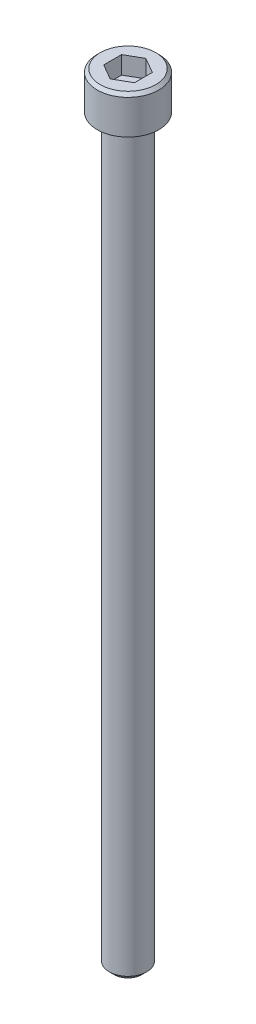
ISO-10303-21;
HEADER;
FILE_DESCRIPTION(('STEP AP214'),'2;1');
FILE_NAME('part.step','',(''),(''),'','','');
FILE_SCHEMA(('AUTOMOTIVE_DESIGN { 1 0 10303 214 1 1 1 1 }'));
ENDSEC;
DATA;
#1=APPLICATION_CONTEXT('core data for automotive mechanical design processes');
#2=APPLICATION_PROTOCOL_DEFINITION('international standard','automotive_design',2000,#1);
#3=PRODUCT_CONTEXT('',#1,'mechanical');
#4=PRODUCT('Part','Part','',(#3));
#5=PRODUCT_RELATED_PRODUCT_CATEGORY('part','',(#4));
#6=PRODUCT_DEFINITION_FORMATION('','',#4);
#7=PRODUCT_DEFINITION_CONTEXT('part definition',#1,'design');
#8=PRODUCT_DEFINITION('design','',#6,#7);
#9=PRODUCT_DEFINITION_SHAPE('','',#8);
#10=(LENGTH_UNIT() NAMED_UNIT(*) SI_UNIT(.MILLI.,.METRE.));
#11=(NAMED_UNIT(*) PLANE_ANGLE_UNIT() SI_UNIT($,.RADIAN.));
#12=(NAMED_UNIT(*) SI_UNIT($,.STERADIAN.) SOLID_ANGLE_UNIT());
#13=UNCERTAINTY_MEASURE_WITH_UNIT(LENGTH_MEASURE(1.E-05),#10,'distance_accuracy_value','');
#14=(GEOMETRIC_REPRESENTATION_CONTEXT(3) GLOBAL_UNCERTAINTY_ASSIGNED_CONTEXT((#13)) GLOBAL_UNIT_ASSIGNED_CONTEXT((#10,
#11,#12)) REPRESENTATION_CONTEXT('',''));
#15=CARTESIAN_POINT('',(0.,0.,0.));
#16=DIRECTION('',(0.,0.,1.));
#17=DIRECTION('',(1.,0.,0.));
#18=AXIS2_PLACEMENT_3D('',#15,#16,#17);
#19=CARTESIAN_POINT('',(-1.11022302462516E-13,0.,-2.22044604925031E-13));
#20=DIRECTION('',(0.,-1.,0.));
#21=DIRECTION('',(0.,0.,-1.));
#22=AXIS2_PLACEMENT_3D('',#19,#20,#21);
#23=PLANE('',#22);
#24=CARTESIAN_POINT('',(-1.11022302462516E-13,0.,-2.22044604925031E-13));
#25=DIRECTION('',(0.,-1.,0.));
#26=DIRECTION('',(0.,0.,-1.));
#27=AXIS2_PLACEMENT_3D('',#24,#25,#26);
#28=CIRCLE('',#27,2.413);
#29=CARTESIAN_POINT('',(-1.11406779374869E-13,0.,-2.41300000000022));
#30=VERTEX_POINT('',#29);
#31=EDGE_CURVE('E11',#30,#30,#28,.T.);
#32=ORIENTED_EDGE('',*,*,#31,.F.);
#33=EDGE_LOOP('',(#32));
#34=FACE_BOUND('',#33,.T.);
#35=CARTESIAN_POINT('',(-1.11022302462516E-13,0.,-2.22044604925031E-13));
#36=DIRECTION('',(0.,-1.,0.));
#37=DIRECTION('',(0.,0.,-1.));
#38=AXIS2_PLACEMENT_3D('',#35,#36,#37);
#39=CIRCLE('',#38,3.96875);
#40=CARTESIAN_POINT('',(-1.11654665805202E-13,0.,-3.96875000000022));
#41=VERTEX_POINT('',#40);
#42=EDGE_CURVE('E33',#41,#41,#39,.T.);
#43=ORIENTED_EDGE('',*,*,#42,.T.);
#44=EDGE_LOOP('',(#43));
#45=FACE_BOUND('',#44,.T.);
#46=ADVANCED_FACE('F26',(#34,#45),#23,.T.);
#47=CARTESIAN_POINT('',(-1.11022302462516E-13,0.,-2.22044604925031E-13));
#48=DIRECTION('',(0.,-1.,0.));
#49=DIRECTION('',(0.,0.,-1.));
#50=AXIS2_PLACEMENT_3D('',#47,#48,#49);
#51=CYLINDRICAL_SURFACE('',#50,3.96875);
#52=CARTESIAN_POINT('',(-1.2490009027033E-13,4.42912500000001,-2.22044604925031E-13));
#53=DIRECTION('',(0.,-1.,0.));
#54=DIRECTION('',(0.,0.,-1.));
#55=AXIS2_PLACEMENT_3D('',#52,#53,#54);
#56=CIRCLE('',#55,3.96875);
#57=CARTESIAN_POINT('',(-1.25532453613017E-13,4.42912500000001,-3.96875000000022));
#58=VERTEX_POINT('',#57);
#59=EDGE_CURVE('E143',#58,#58,#56,.T.);
#60=ORIENTED_EDGE('',*,*,#59,.T.);
#61=EDGE_LOOP('',(#60));
#62=FACE_BOUND('',#61,.T.);
#63=ORIENTED_EDGE('',*,*,#42,.F.);
#64=EDGE_LOOP('',(#63));
#65=FACE_BOUND('',#64,.T.);
#66=ADVANCED_FACE('F149',(#62,#65),#51,.T.);
#67=CARTESIAN_POINT('',(-1.2490009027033E-13,4.42912500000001,-2.22044604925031E-13));
#68=DIRECTION('',(0.,-1.,0.));
#69=DIRECTION('',(0.,0.,-1.));
#70=AXIS2_PLACEMENT_3D('',#67,#68,#69);
#71=CONICAL_SURFACE('',#70,3.96875,0.785398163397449);
#72=CARTESIAN_POINT('',(-1.2490009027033E-13,4.826,-2.22044604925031E-13));
#73=DIRECTION('',(0.,-1.,0.));
#74=DIRECTION('',(0.,0.,-1.));
#75=AXIS2_PLACEMENT_3D('',#72,#73,#74);
#76=CIRCLE('',#75,3.571875);
#77=CARTESIAN_POINT('',(-1.25469217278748E-13,4.826,-3.57187500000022));
#78=VERTEX_POINT('',#77);
#79=EDGE_CURVE('E140',#78,#78,#76,.T.);
#80=ORIENTED_EDGE('',*,*,#79,.T.);
#81=EDGE_LOOP('',(#80));
#82=FACE_BOUND('',#81,.T.);
#83=ORIENTED_EDGE('',*,*,#59,.F.);
#84=EDGE_LOOP('',(#83));
#85=FACE_BOUND('',#84,.T.);
#86=ADVANCED_FACE('F151',(#82,#85),#71,.T.);
#87=CARTESIAN_POINT('',(3.57187499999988,4.826,-2.22044604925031E-13));
#88=DIRECTION('',(0.,1.,0.));
#89=DIRECTION('',(0.,0.,1.));
#90=AXIS2_PLACEMENT_3D('',#87,#88,#89);
#91=PLANE('',#90);
#92=DIRECTION('',(1.02069543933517E-11,0.,1.));
#93=VECTOR('',#92,1.);
#94=CARTESIAN_POINT('',(-1.98501000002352,4.82600000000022,-1.14604605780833));
#95=LINE('',#94,#93);
#96=CARTESIAN_POINT('',(-1.98501000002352,4.82600000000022,-1.14604605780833));
#97=VERTEX_POINT('',#96);
#98=CARTESIAN_POINT('',(-1.98501000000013,4.826,1.14604605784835));
#99=VERTEX_POINT('',#98);
#100=EDGE_CURVE('E40',#97,#99,#95,.T.);
#101=ORIENTED_EDGE('',*,*,#100,.F.);
#102=DIRECTION('',(-0.866025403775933,0.,0.500000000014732));
#103=VECTOR('',#102,1.);
#104=CARTESIAN_POINT('',(-3.52218254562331E-11,4.82600000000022,-2.2920921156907));
#105=LINE('',#104,#103);
#106=CARTESIAN_POINT('',(-3.52218254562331E-11,4.82600000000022,-2.2920921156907));
#107=VERTEX_POINT('',#106);
#108=EDGE_CURVE('E110',#107,#97,#105,.T.);
#109=ORIENTED_EDGE('',*,*,#108,.F.);
#110=DIRECTION('',(-0.866025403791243,0.,-0.499999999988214));
#111=VECTOR('',#110,1.);
#112=CARTESIAN_POINT('',(1.98500999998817,4.82600000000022,-1.14604605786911));
#113=LINE('',#112,#111);
#114=CARTESIAN_POINT('',(1.98500999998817,4.82600000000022,-1.14604605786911));
#115=VERTEX_POINT('',#114);
#116=EDGE_CURVE('E104',#115,#107,#113,.T.);
#117=ORIENTED_EDGE('',*,*,#116,.F.);
#118=DIRECTION('',(-1.02069543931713E-11,0.,-1.));
#119=VECTOR('',#118,1.);
#120=CARTESIAN_POINT('',(1.98501000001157,4.826,1.14604605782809));
#121=LINE('',#120,#119);
#122=CARTESIAN_POINT('',(1.98501000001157,4.826,1.14604605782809));
#123=VERTEX_POINT('',#122);
#124=EDGE_CURVE('E102',#123,#115,#121,.T.);
#125=ORIENTED_EDGE('',*,*,#124,.F.);
#126=DIRECTION('',(0.866025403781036,0.,-0.500000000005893));
#127=VECTOR('',#126,1.);
#128=CARTESIAN_POINT('',(1.15740750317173E-11,4.826,2.2920921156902));
#129=LINE('',#128,#127);
#130=CARTESIAN_POINT('',(1.15740750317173E-11,4.826,2.2920921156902));
#131=VERTEX_POINT('',#130);
#132=EDGE_CURVE('E83',#131,#123,#129,.T.);
#133=ORIENTED_EDGE('',*,*,#132,.F.);
#134=DIRECTION('',(0.86602540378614,0.,0.499999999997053));
#135=VECTOR('',#134,1.);
#136=CARTESIAN_POINT('',(-1.98501000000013,4.826,1.14604605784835));
#137=LINE('',#136,#135);
#138=EDGE_CURVE('E94',#99,#131,#137,.T.);
#139=ORIENTED_EDGE('',*,*,#138,.F.);
#140=EDGE_LOOP('',(#101,#109,#117,#125,#133,#139));
#141=FACE_BOUND('',#140,.T.);
#142=ORIENTED_EDGE('',*,*,#79,.F.);
#143=EDGE_LOOP('',(#142));
#144=FACE_BOUND('',#143,.T.);
#145=ADVANCED_FACE('F98',(#141,#144),#91,.T.);
#146=CARTESIAN_POINT('',(5.55111512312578E-13,-95.2499999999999,2.22044604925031E-13));
#147=DIRECTION('',(0.,-1.,0.));
#148=DIRECTION('',(0.,0.,-1.));
#149=AXIS2_PLACEMENT_3D('',#146,#147,#148);
#150=PLANE('',#149);
#151=CARTESIAN_POINT('',(5.41233724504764E-13,-95.2499999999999,2.22044604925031E-13));
#152=DIRECTION('',(0.,-1.,0.));
#153=DIRECTION('',(0.,0.,-1.));
#154=AXIS2_PLACEMENT_3D('',#151,#152,#153);
#155=CIRCLE('',#154,1.78308);
#156=CARTESIAN_POINT('',(5.40949616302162E-13,-95.2499999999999,-1.78307999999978));
#157=VERTEX_POINT('',#156);
#158=EDGE_CURVE('E137',#157,#157,#155,.T.);
#159=ORIENTED_EDGE('',*,*,#158,.T.);
#160=EDGE_LOOP('',(#159));
#161=FACE_BOUND('',#160,.T.);
#162=ADVANCED_FACE('F163',(#161),#150,.T.);
#163=CARTESIAN_POINT('',(5.41233724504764E-13,-95.2499999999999,2.22044604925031E-13));
#164=DIRECTION('',(0.,1.,0.));
#165=DIRECTION('',(0.,0.,1.));
#166=AXIS2_PLACEMENT_3D('',#163,#164,#165);
#167=CONICAL_SURFACE('',#166,1.78308,0.785398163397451);
#168=CARTESIAN_POINT('',(5.41233724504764E-13,-94.6200799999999,2.22044604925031E-13));
#169=DIRECTION('',(0.,-1.,0.));
#170=DIRECTION('',(0.,0.,-1.));
#171=AXIS2_PLACEMENT_3D('',#168,#169,#170);
#172=CIRCLE('',#171,2.413);
#173=CARTESIAN_POINT('',(5.4084924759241E-13,-94.6200799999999,-2.41299999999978));
#174=VERTEX_POINT('',#173);
#175=EDGE_CURVE('E128',#174,#174,#172,.T.);
#176=ORIENTED_EDGE('',*,*,#175,.T.);
#177=EDGE_LOOP('',(#176));
#178=FACE_BOUND('',#177,.T.);
#179=ORIENTED_EDGE('',*,*,#158,.F.);
#180=EDGE_LOOP('',(#179));
#181=FACE_BOUND('',#180,.T.);
#182=ADVANCED_FACE('F166',(#178,#181),#167,.T.);
#183=CARTESIAN_POINT('',(-1.11022302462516E-13,0.,-2.22044604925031E-13));
#184=DIRECTION('',(0.,-1.,0.));
#185=DIRECTION('',(0.,0.,-1.));
#186=AXIS2_PLACEMENT_3D('',#183,#184,#185);
#187=CYLINDRICAL_SURFACE('',#186,2.413);
#188=ORIENTED_EDGE('',*,*,#31,.T.);
#189=EDGE_LOOP('',(#188));
#190=FACE_BOUND('',#189,.T.);
#191=ORIENTED_EDGE('',*,*,#175,.F.);
#192=EDGE_LOOP('',(#191));
#193=FACE_BOUND('',#192,.T.);
#194=ADVANCED_FACE('F170',(#190,#193),#187,.T.);
#195=CARTESIAN_POINT('',(-1.9850100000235,2.54000000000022,-1.14604605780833));
#196=DIRECTION('',(-1.,0.,1.02066357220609E-11));
#197=DIRECTION('',(1.02069543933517E-11,0.,1.));
#198=AXIS2_PLACEMENT_3D('',#195,#196,#197);
#199=PLANE('',#198);
#200=ORIENTED_EDGE('',*,*,#100,.T.);
#201=DIRECTION('',(0.,1.,0.));
#202=VECTOR('',#201,1.);
#203=CARTESIAN_POINT('',(-1.98501000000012,2.54,1.14604605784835));
#204=LINE('',#203,#202);
#205=CARTESIAN_POINT('',(-1.98501000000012,2.54,1.14604605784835));
#206=VERTEX_POINT('',#205);
#207=EDGE_CURVE('E91',#206,#99,#204,.T.);
#208=ORIENTED_EDGE('',*,*,#207,.F.);
#209=DIRECTION('',(1.02069543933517E-11,0.,1.));
#210=VECTOR('',#209,1.);
#211=CARTESIAN_POINT('',(-1.9850100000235,2.54000000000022,-1.14604605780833));
#212=LINE('',#211,#210);
#213=CARTESIAN_POINT('',(-1.9850100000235,2.54000000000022,-1.14604605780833));
#214=VERTEX_POINT('',#213);
#215=EDGE_CURVE('E112',#214,#206,#212,.T.);
#216=ORIENTED_EDGE('',*,*,#215,.F.);
#217=DIRECTION('',(0.,1.,0.));
#218=VECTOR('',#217,1.);
#219=CARTESIAN_POINT('',(-1.9850100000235,2.54000000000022,-1.14604605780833));
#220=LINE('',#219,#218);
#221=EDGE_CURVE('E47',#214,#97,#220,.T.);
#222=ORIENTED_EDGE('',*,*,#221,.T.);
#223=EDGE_LOOP('',(#200,#208,#216,#222));
#224=FACE_BOUND('',#223,.T.);
#225=ADVANCED_FACE('F174',(#224),#199,.F.);
#226=CARTESIAN_POINT('',(-3.52079476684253E-11,2.54000000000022,-2.2920921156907));
#227=DIRECTION('',(-0.500000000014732,0.,-0.866025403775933));
#228=DIRECTION('',(-0.866025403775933,0.,0.500000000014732));
#229=AXIS2_PLACEMENT_3D('',#226,#227,#228);
#230=PLANE('',#229);
#231=ORIENTED_EDGE('',*,*,#108,.T.);
#232=ORIENTED_EDGE('',*,*,#221,.F.);
#233=DIRECTION('',(-0.866025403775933,0.,0.500000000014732));
#234=VECTOR('',#233,1.);
#235=CARTESIAN_POINT('',(-3.52079476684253E-11,2.54000000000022,-2.2920921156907));
#236=LINE('',#235,#234);
#237=CARTESIAN_POINT('',(-3.52079476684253E-11,2.54000000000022,-2.2920921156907));
#238=VERTEX_POINT('',#237);
#239=EDGE_CURVE('E124',#238,#214,#236,.T.);
#240=ORIENTED_EDGE('',*,*,#239,.F.);
#241=DIRECTION('',(0.,1.,0.));
#242=VECTOR('',#241,1.);
#243=CARTESIAN_POINT('',(-3.52079476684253E-11,2.54000000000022,-2.2920921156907));
#244=LINE('',#243,#242);
#245=EDGE_CURVE('E129',#238,#107,#244,.T.);
#246=ORIENTED_EDGE('',*,*,#245,.T.);
#247=EDGE_LOOP('',(#231,#232,#240,#246));
#248=FACE_BOUND('',#247,.T.);
#249=ADVANCED_FACE('F178',(#248),#230,.F.);
#250=CARTESIAN_POINT('',(1.98500999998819,2.54000000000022,-1.14604605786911));
#251=DIRECTION('',(0.499999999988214,0.,-0.866025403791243));
#252=DIRECTION('',(-0.866025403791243,0.,-0.499999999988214));
#253=AXIS2_PLACEMENT_3D('',#250,#251,#252);
#254=PLANE('',#253);
#255=ORIENTED_EDGE('',*,*,#116,.T.);
#256=ORIENTED_EDGE('',*,*,#245,.F.);
#257=DIRECTION('',(-0.866025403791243,0.,-0.499999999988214));
#258=VECTOR('',#257,1.);
#259=CARTESIAN_POINT('',(1.98500999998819,2.54000000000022,-1.14604605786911));
#260=LINE('',#259,#258);
#261=CARTESIAN_POINT('',(1.98500999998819,2.54000000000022,-1.14604605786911));
#262=VERTEX_POINT('',#261);
#263=EDGE_CURVE('E121',#262,#238,#260,.T.);
#264=ORIENTED_EDGE('',*,*,#263,.F.);
#265=DIRECTION('',(0.,1.,0.));
#266=VECTOR('',#265,1.);
#267=CARTESIAN_POINT('',(1.98500999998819,2.54000000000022,-1.14604605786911));
#268=LINE('',#267,#266);
#269=EDGE_CURVE('E131',#262,#115,#268,.T.);
#270=ORIENTED_EDGE('',*,*,#269,.T.);
#271=EDGE_LOOP('',(#255,#256,#264,#270));
#272=FACE_BOUND('',#271,.T.);
#273=ADVANCED_FACE('F187',(#272),#254,.F.);
#274=CARTESIAN_POINT('',(1.98501000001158,2.54,1.14604605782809));
#275=DIRECTION('',(1.,0.,-1.02066357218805E-11));
#276=DIRECTION('',(-1.02069543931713E-11,0.,-1.));
#277=AXIS2_PLACEMENT_3D('',#274,#275,#276);
#278=PLANE('',#277);
#279=ORIENTED_EDGE('',*,*,#124,.T.);
#280=ORIENTED_EDGE('',*,*,#269,.F.);
#281=DIRECTION('',(-1.02069543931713E-11,0.,-1.));
#282=VECTOR('',#281,1.);
#283=CARTESIAN_POINT('',(1.98501000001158,2.54,1.14604605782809));
#284=LINE('',#283,#282);
#285=CARTESIAN_POINT('',(1.98501000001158,2.54,1.14604605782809));
#286=VERTEX_POINT('',#285);
#287=EDGE_CURVE('E118',#286,#262,#284,.T.);
#288=ORIENTED_EDGE('',*,*,#287,.F.);
#289=DIRECTION('',(0.,1.,0.));
#290=VECTOR('',#289,1.);
#291=CARTESIAN_POINT('',(1.98501000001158,2.54,1.14604605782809));
#292=LINE('',#291,#290);
#293=EDGE_CURVE('E90',#286,#123,#292,.T.);
#294=ORIENTED_EDGE('',*,*,#293,.T.);
#295=EDGE_LOOP('',(#279,#280,#288,#294));
#296=FACE_BOUND('',#295,.T.);
#297=ADVANCED_FACE('F184',(#296),#278,.F.);
#298=CARTESIAN_POINT('',(1.15879528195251E-11,2.54,2.2920921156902));
#299=DIRECTION('',(0.500000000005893,0.,0.866025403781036));
#300=DIRECTION('',(0.866025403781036,0.,-0.500000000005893));
#301=AXIS2_PLACEMENT_3D('',#298,#299,#300);
#302=PLANE('',#301);
#303=ORIENTED_EDGE('',*,*,#132,.T.);
#304=ORIENTED_EDGE('',*,*,#293,.F.);
#305=DIRECTION('',(0.866025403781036,0.,-0.500000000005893));
#306=VECTOR('',#305,1.);
#307=CARTESIAN_POINT('',(1.15879528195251E-11,2.54,2.2920921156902));
#308=LINE('',#307,#306);
#309=CARTESIAN_POINT('',(1.15879528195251E-11,2.54,2.2920921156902));
#310=VERTEX_POINT('',#309);
#311=EDGE_CURVE('E86',#310,#286,#308,.T.);
#312=ORIENTED_EDGE('',*,*,#311,.F.);
#313=DIRECTION('',(0.,1.,0.));
#314=VECTOR('',#313,1.);
#315=CARTESIAN_POINT('',(1.15879528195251E-11,2.54,2.2920921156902));
#316=LINE('',#315,#314);
#317=EDGE_CURVE('E79',#310,#131,#316,.T.);
#318=ORIENTED_EDGE('',*,*,#317,.T.);
#319=EDGE_LOOP('',(#303,#304,#312,#318));
#320=FACE_BOUND('',#319,.T.);
#321=ADVANCED_FACE('F81',(#320),#302,.F.);
#322=CARTESIAN_POINT('',(-1.98501000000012,2.54,1.14604605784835));
#323=DIRECTION('',(-0.499999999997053,0.,0.86602540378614));
#324=DIRECTION('',(0.86602540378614,0.,0.499999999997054));
#325=AXIS2_PLACEMENT_3D('',#322,#323,#324);
#326=PLANE('',#325);
#327=ORIENTED_EDGE('',*,*,#138,.T.);
#328=ORIENTED_EDGE('',*,*,#317,.F.);
#329=DIRECTION('',(0.86602540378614,0.,0.499999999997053));
#330=VECTOR('',#329,1.);
#331=CARTESIAN_POINT('',(-1.98501000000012,2.54,1.14604605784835));
#332=LINE('',#331,#330);
#333=EDGE_CURVE('E115',#206,#310,#332,.T.);
#334=ORIENTED_EDGE('',*,*,#333,.F.);
#335=ORIENTED_EDGE('',*,*,#207,.T.);
#336=EDGE_LOOP('',(#327,#328,#334,#335));
#337=FACE_BOUND('',#336,.T.);
#338=ADVANCED_FACE('F95',(#337),#326,.F.);
#339=CARTESIAN_POINT('',(-1.9850100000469,2.54000000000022,-3.43813817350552));
#340=DIRECTION('',(0.,-1.,0.));
#341=DIRECTION('',(0.,0.,-1.));
#342=AXIS2_PLACEMENT_3D('',#339,#340,#341);
#343=PLANE('',#342);
#344=ORIENTED_EDGE('',*,*,#215,.T.);
#345=ORIENTED_EDGE('',*,*,#333,.T.);
#346=ORIENTED_EDGE('',*,*,#311,.T.);
#347=ORIENTED_EDGE('',*,*,#287,.T.);
#348=ORIENTED_EDGE('',*,*,#263,.T.);
#349=ORIENTED_EDGE('',*,*,#239,.T.);
#350=EDGE_LOOP('',(#344,#345,#346,#347,#348,#349));
#351=FACE_BOUND('',#350,.T.);
#352=ADVANCED_FACE('F181',(#351),#343,.F.);
#353=CLOSED_SHELL('',(#46,#66,#86,#145,#162,#182,#194,#225,#249,#273,#297,#321,#338,#352));
#354=MANIFOLD_SOLID_BREP('B2',#353);
#355=ADVANCED_BREP_SHAPE_REPRESENTATION('',(#18,#354),#14);
#356=SHAPE_DEFINITION_REPRESENTATION(#9,#355);
ENDSEC;
END-ISO-10303-21;
